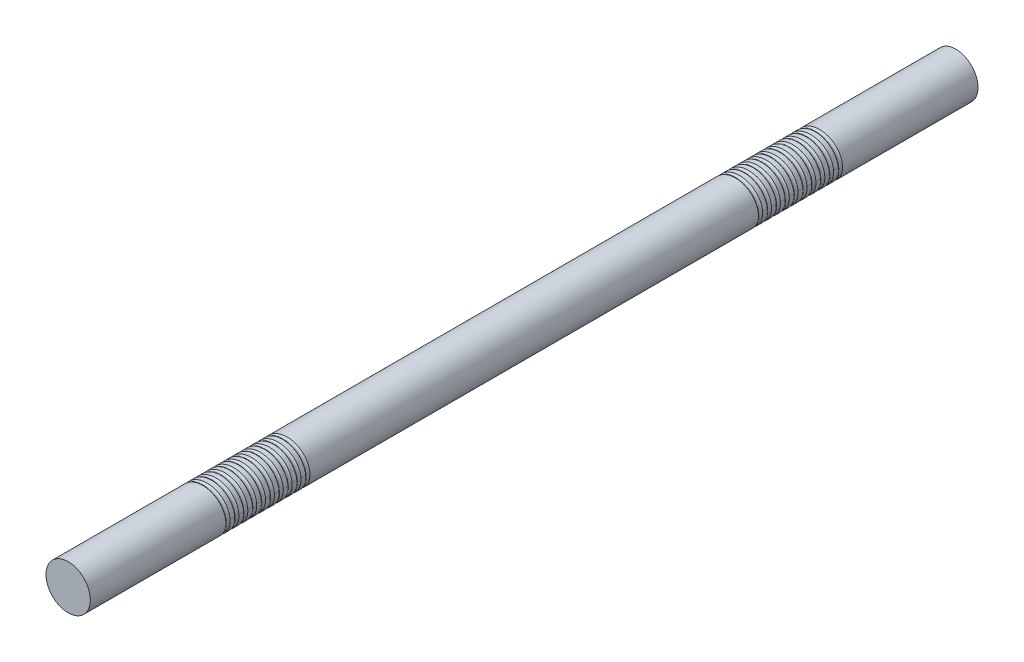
from build123d import *

# Parameters (mm, degrees)
SKETCH1_R              = 25
BOSS_EXTRUDE1_DEPTH    = 1000
CUT_SWEEP1_PITCH       = 10
CUT_SWEEP1_HEIGHT      = 100
CUT_SWEEP1_RADIUS      = 27.116666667
CUT_SWEEP1_START_ANGLE = -180
SKETCH3_R              = 3.175
LPATTERN1_COUNT        = 2
LPATTERN1_PITCH        = 600


with BuildPart() as part:
    # Sketch1 → Boss-Extrude1 (new body)
    with BuildSketch(Plane.XY):
        Circle(SKETCH1_R)
    extrude(amount=BOSS_EXTRUDE1_DEPTH)

    # Cut-Sweep1: sweep along a helix
    with BuildLine() as cut_sweep1_path:
        add(Helix(CUT_SWEEP1_PITCH, CUT_SWEEP1_HEIGHT, CUT_SWEEP1_RADIUS, center=(0, 0, 150), direction=(0, 0, 1), mode=Mode.PRIVATE).rotate(Axis((0, 0, 150), (0, 0, 1)), CUT_SWEEP1_START_ANGLE))
    # Sketch3 → Cut-Sweep1 (sweep, cut)
    with BuildSketch(Plane(origin=(0, 0, 0), x_dir=(1, 0, 0), z_dir=(0, 1, 0))):
        with Locations((-27.116666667, -150)):
            Circle(SKETCH3_R)
    cut_sweep1 = sweep(path=cut_sweep1_path.line, is_frenet=True, mode=Mode.SUBTRACT)

    # LPattern1: Cut-Sweep1 ×2
    with Locations(*[(0, 0, i * LPATTERN1_PITCH) for i in range(1, LPATTERN1_COUNT)]):
        add(cut_sweep1, mode=Mode.SUBTRACT)


solid = part.part
